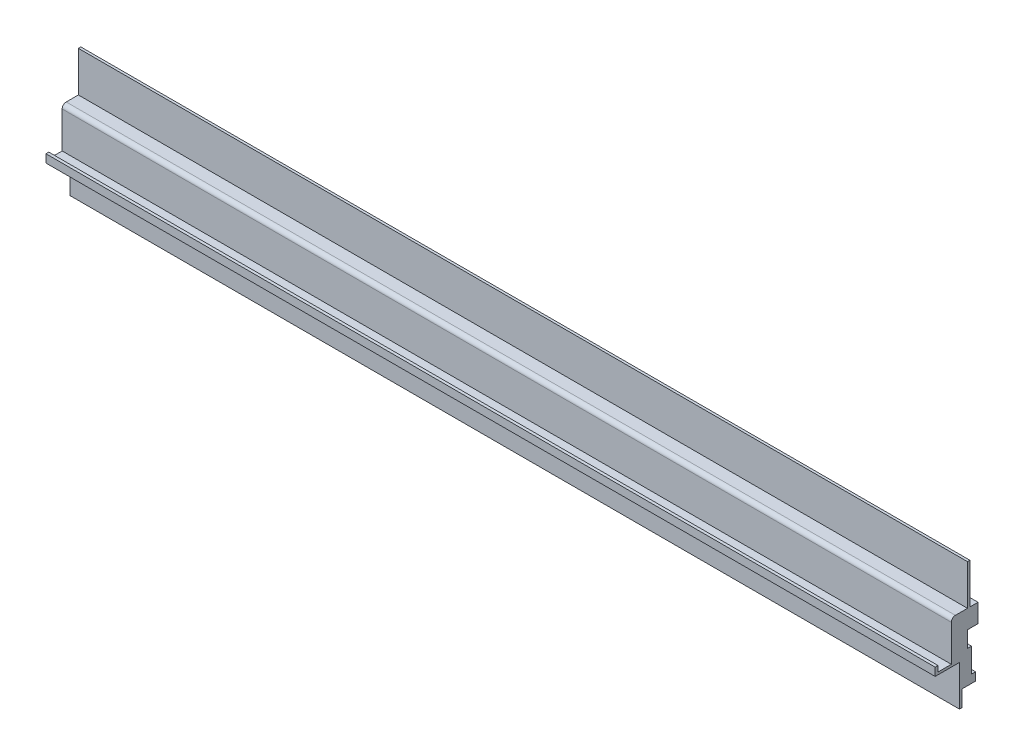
from build123d import *

# Parameters (mm, degrees)
BOSS_EXTRUDE1_DEPTH = 550
FILLET1_R           = 5


with BuildPart() as part:
    # Sketch1 → Boss-Extrude1 (new, symmetric)
    with BuildSketch(Plane(origin=(0, 0, 0), x_dir=(0, 0, -1), z_dir=(1, 0, 0))):
        Polygon((10, 34.517180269), (10, -15.482819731), (-10, -15.482819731), (-10, -65.482819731), (-26.495562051, -65.482819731), (-26.495562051, -58.482819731), (-30, -58.482819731), (-30, -68.482819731), (0, -68.482819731), (0, -118.482819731), (3, -118.482819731), (3, -98.482819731), (20, -98.482819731), (20, -88.482819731), (15, -88.482819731), (15, -58.482819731), (10, -58.482819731), (10, -38.482819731), (23, -38.482819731), (23, -15.482819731), (13, -15.482819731), (13, 34.517180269), align=None)
    extrude(amount=BOSS_EXTRUDE1_DEPTH, both=True)

    # Fillet1
    fillet1_edges = [part.edges().sort_by_distance(p)[0] for p in [
        (0, -15.482819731, 10),
    ]]
    fillet(fillet1_edges, radius=FILLET1_R)


solid = part.part
